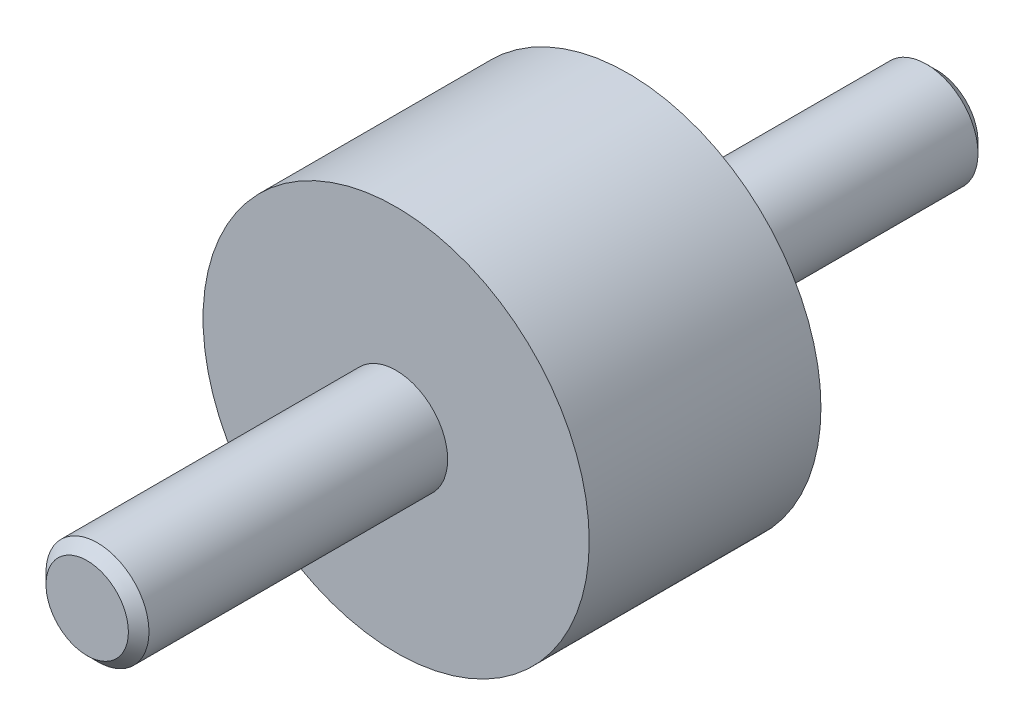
ISO-10303-21;
HEADER;
FILE_DESCRIPTION(('STEP AP214'),'2;1');
FILE_NAME('part.step','',(''),(''),'','','');
FILE_SCHEMA(('AUTOMOTIVE_DESIGN { 1 0 10303 214 1 1 1 1 }'));
ENDSEC;
DATA;
#1=APPLICATION_CONTEXT('core data for automotive mechanical design processes');
#2=APPLICATION_PROTOCOL_DEFINITION('international standard','automotive_design',2000,#1);
#3=PRODUCT_CONTEXT('',#1,'mechanical');
#4=PRODUCT('Part','Part','',(#3));
#5=PRODUCT_RELATED_PRODUCT_CATEGORY('part','',(#4));
#6=PRODUCT_DEFINITION_FORMATION('','',#4);
#7=PRODUCT_DEFINITION_CONTEXT('part definition',#1,'design');
#8=PRODUCT_DEFINITION('design','',#6,#7);
#9=PRODUCT_DEFINITION_SHAPE('','',#8);
#10=(LENGTH_UNIT() NAMED_UNIT(*) SI_UNIT(.MILLI.,.METRE.));
#11=(NAMED_UNIT(*) PLANE_ANGLE_UNIT() SI_UNIT($,.RADIAN.));
#12=(NAMED_UNIT(*) SI_UNIT($,.STERADIAN.) SOLID_ANGLE_UNIT());
#13=UNCERTAINTY_MEASURE_WITH_UNIT(LENGTH_MEASURE(1.E-05),#10,'distance_accuracy_value','');
#14=(GEOMETRIC_REPRESENTATION_CONTEXT(3) GLOBAL_UNCERTAINTY_ASSIGNED_CONTEXT((#13)) GLOBAL_UNIT_ASSIGNED_CONTEXT((#10,
#11,#12)) REPRESENTATION_CONTEXT('',''));
#15=CARTESIAN_POINT('',(0.,0.,0.));
#16=DIRECTION('',(0.,0.,1.));
#17=DIRECTION('',(1.,0.,0.));
#18=AXIS2_PLACEMENT_3D('',#15,#16,#17);
#19=CARTESIAN_POINT('',(0.,0.,0.));
#20=DIRECTION('',(0.,0.,1.));
#21=DIRECTION('',(1.,0.,0.));
#22=AXIS2_PLACEMENT_3D('',#19,#20,#21);
#23=PLANE('',#22);
#24=CARTESIAN_POINT('',(0.,0.,0.));
#25=DIRECTION('',(0.,0.,1.));
#26=DIRECTION('',(1.,0.,0.));
#27=AXIS2_PLACEMENT_3D('',#24,#25,#26);
#28=CIRCLE('',#27,7.5);
#29=CARTESIAN_POINT('',(7.5,0.,0.));
#30=VERTEX_POINT('',#29);
#31=EDGE_CURVE('E61',#30,#30,#28,.T.);
#32=ORIENTED_EDGE('',*,*,#31,.F.);
#33=EDGE_LOOP('',(#32));
#34=FACE_BOUND('',#33,.T.);
#35=CARTESIAN_POINT('',(0.,0.,0.));
#36=DIRECTION('',(0.,0.,1.));
#37=DIRECTION('',(1.,0.,0.));
#38=AXIS2_PLACEMENT_3D('',#35,#36,#37);
#39=CIRCLE('',#38,2.);
#40=CARTESIAN_POINT('',(2.,0.,0.));
#41=VERTEX_POINT('',#40);
#42=EDGE_CURVE('E54',#41,#41,#39,.F.);
#43=ORIENTED_EDGE('',*,*,#42,.F.);
#44=EDGE_LOOP('',(#43));
#45=FACE_BOUND('',#44,.T.);
#46=ADVANCED_FACE('F34',(#34,#45),#23,.F.);
#47=CARTESIAN_POINT('',(0.,0.,9.));
#48=DIRECTION('',(0.,0.,1.));
#49=DIRECTION('',(1.,0.,0.));
#50=AXIS2_PLACEMENT_3D('',#47,#48,#49);
#51=PLANE('',#50);
#52=CARTESIAN_POINT('',(0.,0.,9.));
#53=DIRECTION('',(0.,0.,1.));
#54=DIRECTION('',(1.,0.,0.));
#55=AXIS2_PLACEMENT_3D('',#52,#53,#54);
#56=CIRCLE('',#55,7.5);
#57=CARTESIAN_POINT('',(7.5,0.,9.));
#58=VERTEX_POINT('',#57);
#59=EDGE_CURVE('E57',#58,#58,#56,.T.);
#60=ORIENTED_EDGE('',*,*,#59,.T.);
#61=EDGE_LOOP('',(#60));
#62=FACE_BOUND('',#61,.T.);
#63=CARTESIAN_POINT('',(0.,0.,9.));
#64=DIRECTION('',(0.,0.,1.));
#65=DIRECTION('',(1.,0.,0.));
#66=AXIS2_PLACEMENT_3D('',#63,#64,#65);
#67=CIRCLE('',#66,2.);
#68=CARTESIAN_POINT('',(2.,0.,9.));
#69=VERTEX_POINT('',#68);
#70=EDGE_CURVE('E64',#69,#69,#67,.T.);
#71=ORIENTED_EDGE('',*,*,#70,.F.);
#72=EDGE_LOOP('',(#71));
#73=FACE_BOUND('',#72,.T.);
#74=ADVANCED_FACE('F70',(#62,#73),#51,.T.);
#75=CARTESIAN_POINT('',(0.,0.,9.));
#76=DIRECTION('',(0.,0.,-1.));
#77=DIRECTION('',(-1.,0.,0.));
#78=AXIS2_PLACEMENT_3D('',#75,#76,#77);
#79=CYLINDRICAL_SURFACE('',#78,7.5);
#80=ORIENTED_EDGE('',*,*,#59,.F.);
#81=EDGE_LOOP('',(#80));
#82=FACE_BOUND('',#81,.T.);
#83=ORIENTED_EDGE('',*,*,#31,.T.);
#84=EDGE_LOOP('',(#83));
#85=FACE_BOUND('',#84,.T.);
#86=ADVANCED_FACE('F36',(#82,#85),#79,.T.);
#87=CARTESIAN_POINT('',(0.,0.,21.));
#88=DIRECTION('',(0.,0.,-1.));
#89=DIRECTION('',(-1.,0.,0.));
#90=AXIS2_PLACEMENT_3D('',#87,#88,#89);
#91=CYLINDRICAL_SURFACE('',#90,2.);
#92=CARTESIAN_POINT('',(0.,0.,20.6));
#93=DIRECTION('',(0.,0.,1.));
#94=DIRECTION('',(1.,0.,0.));
#95=AXIS2_PLACEMENT_3D('',#92,#93,#94);
#96=CIRCLE('',#95,2.);
#97=CARTESIAN_POINT('',(2.,0.,20.6));
#98=VERTEX_POINT('',#97);
#99=EDGE_CURVE('E10',#98,#98,#96,.F.);
#100=ORIENTED_EDGE('',*,*,#99,.T.);
#101=EDGE_LOOP('',(#100));
#102=FACE_BOUND('',#101,.T.);
#103=ORIENTED_EDGE('',*,*,#70,.T.);
#104=EDGE_LOOP('',(#103));
#105=FACE_BOUND('',#104,.T.);
#106=ADVANCED_FACE('F68',(#102,#105),#91,.T.);
#107=CARTESIAN_POINT('',(0.,0.,21.));
#108=DIRECTION('',(0.,0.,1.));
#109=DIRECTION('',(1.,0.,0.));
#110=AXIS2_PLACEMENT_3D('',#107,#108,#109);
#111=PLANE('',#110);
#112=CARTESIAN_POINT('',(0.,0.,21.));
#113=DIRECTION('',(0.,0.,1.));
#114=DIRECTION('',(1.,0.,0.));
#115=AXIS2_PLACEMENT_3D('',#112,#113,#114);
#116=CIRCLE('',#115,1.6);
#117=CARTESIAN_POINT('',(1.6,0.,21.));
#118=VERTEX_POINT('',#117);
#119=EDGE_CURVE('E41',#118,#118,#116,.T.);
#120=ORIENTED_EDGE('',*,*,#119,.T.);
#121=EDGE_LOOP('',(#120));
#122=FACE_BOUND('',#121,.T.);
#123=ADVANCED_FACE('F83',(#122),#111,.T.);
#124=CARTESIAN_POINT('',(0.,0.,-12.));
#125=DIRECTION('',(0.,0.,1.));
#126=DIRECTION('',(1.,0.,0.));
#127=AXIS2_PLACEMENT_3D('',#124,#125,#126);
#128=CYLINDRICAL_SURFACE('',#127,2.);
#129=CARTESIAN_POINT('',(0.,0.,-11.6));
#130=DIRECTION('',(0.,0.,-1.));
#131=DIRECTION('',(-1.,0.,0.));
#132=AXIS2_PLACEMENT_3D('',#129,#130,#131);
#133=CIRCLE('',#132,2.);
#134=CARTESIAN_POINT('',(-2.,0.,-11.6));
#135=VERTEX_POINT('',#134);
#136=EDGE_CURVE('E45',#135,#135,#133,.F.);
#137=ORIENTED_EDGE('',*,*,#136,.T.);
#138=EDGE_LOOP('',(#137));
#139=FACE_BOUND('',#138,.T.);
#140=ORIENTED_EDGE('',*,*,#42,.T.);
#141=EDGE_LOOP('',(#140));
#142=FACE_BOUND('',#141,.T.);
#143=ADVANCED_FACE('F86',(#139,#142),#128,.T.);
#144=CARTESIAN_POINT('',(0.,0.,-12.));
#145=DIRECTION('',(0.,0.,-1.));
#146=DIRECTION('',(-1.,0.,0.));
#147=AXIS2_PLACEMENT_3D('',#144,#145,#146);
#148=PLANE('',#147);
#149=CARTESIAN_POINT('',(0.,0.,-12.));
#150=DIRECTION('',(0.,0.,-1.));
#151=DIRECTION('',(-1.,0.,0.));
#152=AXIS2_PLACEMENT_3D('',#149,#150,#151);
#153=CIRCLE('',#152,1.6);
#154=CARTESIAN_POINT('',(-1.6,0.,-12.));
#155=VERTEX_POINT('',#154);
#156=EDGE_CURVE('E49',#155,#155,#153,.T.);
#157=ORIENTED_EDGE('',*,*,#156,.T.);
#158=EDGE_LOOP('',(#157));
#159=FACE_BOUND('',#158,.T.);
#160=ADVANCED_FACE('F89',(#159),#148,.T.);
#161=CARTESIAN_POINT('',(0.,0.,-12.));
#162=DIRECTION('',(0.,0.,1.));
#163=DIRECTION('',(1.,0.,0.));
#164=AXIS2_PLACEMENT_3D('',#161,#162,#163);
#165=CONICAL_SURFACE('',#164,1.6,0.785398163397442);
#166=ORIENTED_EDGE('',*,*,#136,.F.);
#167=EDGE_LOOP('',(#166));
#168=FACE_BOUND('',#167,.T.);
#169=ORIENTED_EDGE('',*,*,#156,.F.);
#170=EDGE_LOOP('',(#169));
#171=FACE_BOUND('',#170,.T.);
#172=ADVANCED_FACE('F93',(#168,#171),#165,.T.);
#173=CARTESIAN_POINT('',(0.,0.,21.));
#174=DIRECTION('',(0.,0.,-1.));
#175=DIRECTION('',(-1.,0.,0.));
#176=AXIS2_PLACEMENT_3D('',#173,#174,#175);
#177=CONICAL_SURFACE('',#176,1.6,0.785398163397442);
#178=ORIENTED_EDGE('',*,*,#99,.F.);
#179=EDGE_LOOP('',(#178));
#180=FACE_BOUND('',#179,.T.);
#181=ORIENTED_EDGE('',*,*,#119,.F.);
#182=EDGE_LOOP('',(#181));
#183=FACE_BOUND('',#182,.T.);
#184=ADVANCED_FACE('F97',(#180,#183),#177,.T.);
#185=CLOSED_SHELL('',(#46,#74,#86,#106,#123,#143,#160,#172,#184));
#186=MANIFOLD_SOLID_BREP('B2',#185);
#187=ADVANCED_BREP_SHAPE_REPRESENTATION('',(#18,#186),#14);
#188=SHAPE_DEFINITION_REPRESENTATION(#9,#187);
ENDSEC;
END-ISO-10303-21;
